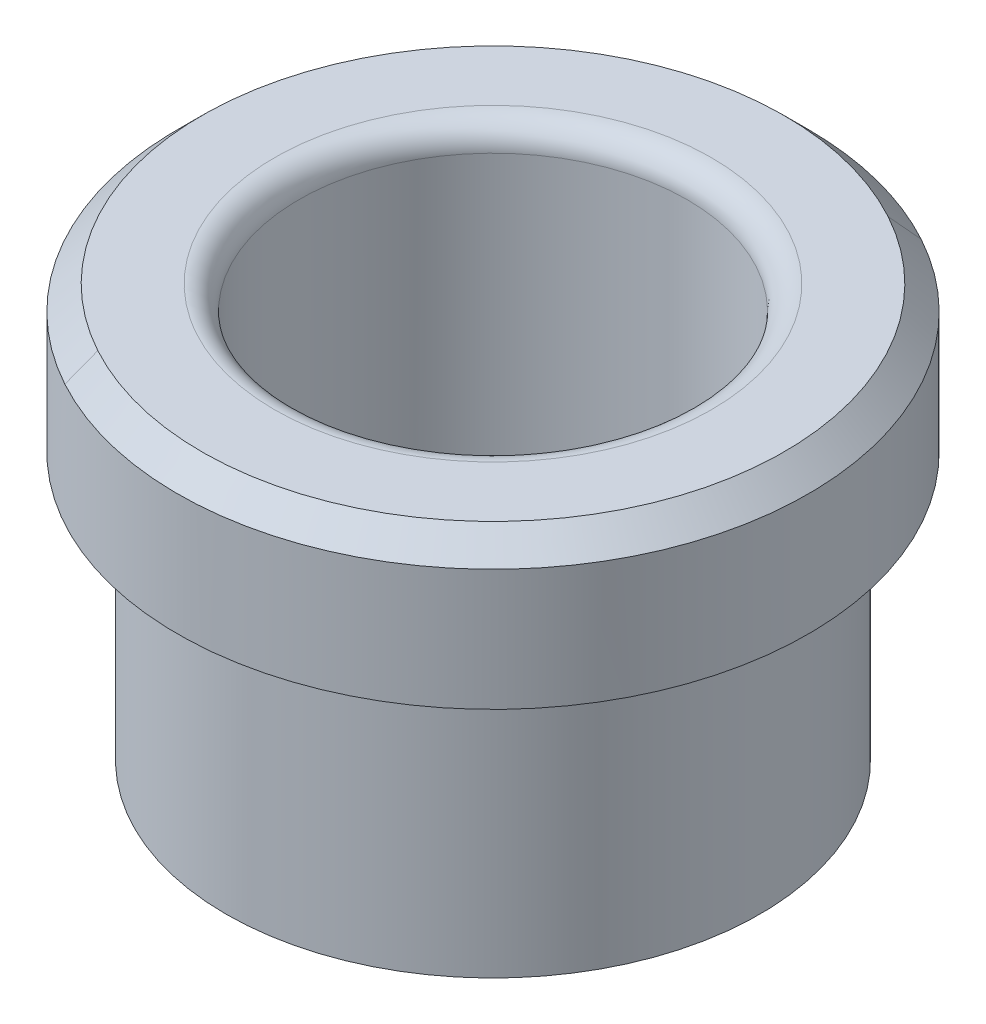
ISO-10303-21;
HEADER;
FILE_DESCRIPTION(('STEP AP214'),'2;1');
FILE_NAME('part.step','',(''),(''),'','','');
FILE_SCHEMA(('AUTOMOTIVE_DESIGN { 1 0 10303 214 1 1 1 1 }'));
ENDSEC;
DATA;
#1=APPLICATION_CONTEXT('core data for automotive mechanical design processes');
#2=APPLICATION_PROTOCOL_DEFINITION('international standard','automotive_design',2000,#1);
#3=PRODUCT_CONTEXT('',#1,'mechanical');
#4=PRODUCT('Part','Part','',(#3));
#5=PRODUCT_RELATED_PRODUCT_CATEGORY('part','',(#4));
#6=PRODUCT_DEFINITION_FORMATION('','',#4);
#7=PRODUCT_DEFINITION_CONTEXT('part definition',#1,'design');
#8=PRODUCT_DEFINITION('design','',#6,#7);
#9=PRODUCT_DEFINITION_SHAPE('','',#8);
#10=(LENGTH_UNIT() NAMED_UNIT(*) SI_UNIT(.MILLI.,.METRE.));
#11=(NAMED_UNIT(*) PLANE_ANGLE_UNIT() SI_UNIT($,.RADIAN.));
#12=(NAMED_UNIT(*) SI_UNIT($,.STERADIAN.) SOLID_ANGLE_UNIT());
#13=UNCERTAINTY_MEASURE_WITH_UNIT(LENGTH_MEASURE(1.E-05),#10,'distance_accuracy_value','');
#14=(GEOMETRIC_REPRESENTATION_CONTEXT(3) GLOBAL_UNCERTAINTY_ASSIGNED_CONTEXT((#13)) GLOBAL_UNIT_ASSIGNED_CONTEXT((#10,
#11,#12)) REPRESENTATION_CONTEXT('',''));
#15=CARTESIAN_POINT('',(0.,0.,0.));
#16=DIRECTION('',(0.,0.,1.));
#17=DIRECTION('',(1.,0.,0.));
#18=AXIS2_PLACEMENT_3D('',#15,#16,#17);
#19=CARTESIAN_POINT('',(0.,-9.99999999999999,0.));
#20=DIRECTION('',(0.,-1.,0.));
#21=DIRECTION('',(0.,0.,-1.));
#22=AXIS2_PLACEMENT_3D('',#19,#20,#21);
#23=CYLINDRICAL_SURFACE('',#22,8.);
#24=CARTESIAN_POINT('',(0.,-16.,0.));
#25=DIRECTION('',(0.,-1.,0.));
#26=DIRECTION('',(0.,0.,-1.));
#27=AXIS2_PLACEMENT_3D('',#24,#25,#26);
#28=CIRCLE('',#27,8.);
#29=CARTESIAN_POINT('',(0.,-16.,-8.));
#30=VERTEX_POINT('',#29);
#31=EDGE_CURVE('E11',#30,#30,#28,.T.);
#32=ORIENTED_EDGE('',*,*,#31,.T.);
#33=EDGE_LOOP('',(#32));
#34=FACE_BOUND('',#33,.T.);
#35=CARTESIAN_POINT('',(0.,-1.,0.));
#36=DIRECTION('',(0.,-1.,0.));
#37=DIRECTION('',(0.,0.,-1.));
#38=AXIS2_PLACEMENT_3D('',#35,#36,#37);
#39=CIRCLE('',#38,8.);
#40=CARTESIAN_POINT('',(0.,-1.,-8.));
#41=VERTEX_POINT('',#40);
#42=EDGE_CURVE('E66',#41,#41,#39,.T.);
#43=ORIENTED_EDGE('',*,*,#42,.F.);
#44=EDGE_LOOP('',(#43));
#45=FACE_BOUND('',#44,.T.);
#46=ADVANCED_FACE('F30',(#34,#45),#23,.F.);
#47=CARTESIAN_POINT('',(0.,-9.99999999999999,0.));
#48=DIRECTION('',(0.,-1.,0.));
#49=DIRECTION('',(0.,0.,-1.));
#50=AXIS2_PLACEMENT_3D('',#47,#48,#49);
#51=CYLINDRICAL_SURFACE('',#50,11.);
#52=CARTESIAN_POINT('',(0.,-6.00000000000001,0.));
#53=DIRECTION('',(0.,-1.,0.));
#54=DIRECTION('',(0.,0.,-1.));
#55=AXIS2_PLACEMENT_3D('',#52,#53,#54);
#56=CIRCLE('',#55,11.);
#57=CARTESIAN_POINT('',(0.,-6.00000000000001,-11.));
#58=VERTEX_POINT('',#57);
#59=EDGE_CURVE('E113',#58,#58,#56,.T.);
#60=ORIENTED_EDGE('',*,*,#59,.T.);
#61=EDGE_LOOP('',(#60));
#62=FACE_BOUND('',#61,.T.);
#63=CARTESIAN_POINT('',(0.,-17.,0.));
#64=DIRECTION('',(0.,-1.,0.));
#65=DIRECTION('',(0.,0.,-1.));
#66=AXIS2_PLACEMENT_3D('',#63,#64,#65);
#67=CIRCLE('',#66,11.);
#68=CARTESIAN_POINT('',(0.,-17.,-11.));
#69=VERTEX_POINT('',#68);
#70=EDGE_CURVE('E147',#69,#69,#67,.T.);
#71=ORIENTED_EDGE('',*,*,#70,.F.);
#72=EDGE_LOOP('',(#71));
#73=FACE_BOUND('',#72,.T.);
#74=ADVANCED_FACE('F32',(#62,#73),#51,.T.);
#75=CARTESIAN_POINT('',(0.,-1.,0.));
#76=DIRECTION('',(0.,-1.,0.));
#77=DIRECTION('',(0.35834444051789,0.,-0.933589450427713));
#78=AXIS2_PLACEMENT_3D('',#75,#76,#77);
#79=TOROIDAL_SURFACE('',#78,9.,1.);
#80=ORIENTED_EDGE('',*,*,#42,.T.);
#81=EDGE_LOOP('',(#80));
#82=FACE_BOUND('',#81,.T.);
#83=CARTESIAN_POINT('',(0.,0.,0.));
#84=DIRECTION('',(0.,1.,0.));
#85=DIRECTION('',(-0.47942553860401,0.,0.877582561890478));
#86=AXIS2_PLACEMENT_3D('',#83,#84,#85);
#87=CIRCLE('',#86,8.99999999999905);
#88=CARTESIAN_POINT('',(-4.31482984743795,0.,7.89824305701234));
#89=VERTEX_POINT('',#88);
#90=CARTESIAN_POINT('',(4.3148297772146,0.,-7.89824309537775));
#91=VERTEX_POINT('',#90);
#92=EDGE_CURVE('E157',#89,#91,#87,.T.);
#93=ORIENTED_EDGE('',*,*,#92,.T.);
#94=CARTESIAN_POINT('',(4.31482975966,0.,-7.89824310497));
#95=CARTESIAN_POINT('',(4.18559642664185,0.,-7.96884715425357));
#96=CARTESIAN_POINT('',(4.05462756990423,0.,-8.03627379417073));
#97=CARTESIAN_POINT('',(3.78954030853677,0.,-8.16462217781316));
#98=CARTESIAN_POINT('',(3.65542190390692,0.,-8.22554392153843));
#99=CARTESIAN_POINT('',(3.38435704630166,0.,-8.34073243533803));
#100=CARTESIAN_POINT('',(3.24741059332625,0.,-8.39499920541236));
#101=CARTESIAN_POINT('',(2.97101998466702,0.,-8.49674792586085));
#102=CARTESIAN_POINT('',(2.83157582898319,0.,-8.544229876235));
#103=CARTESIAN_POINT('',(2.55052563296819,0.,-8.63229433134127));
#104=CARTESIAN_POINT('',(2.40891959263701,0.,-8.67287683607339));
#105=CARTESIAN_POINT('',(2.12388679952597,0.,-8.74704469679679));
#106=CARTESIAN_POINT('',(1.98046004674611,0.,-8.78063005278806));
#107=CARTESIAN_POINT('',(1.69213134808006,0.,-8.84072268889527));
#108=CARTESIAN_POINT('',(1.54722940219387,0.,-8.86722996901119));
#109=CARTESIAN_POINT('',(1.25629940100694,0.,-8.91310259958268));
#110=CARTESIAN_POINT('',(1.11027134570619,0.,-8.93246795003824));
#111=CARTESIAN_POINT('',(0.817440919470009,0.,-8.96401006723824));
#112=CARTESIAN_POINT('',(0.670638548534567,0.,-8.97618683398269));
#113=CARTESIAN_POINT('',(0.376613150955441,0.,-8.99332244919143));
#114=CARTESIAN_POINT('',(0.229390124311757,0.,-8.99828129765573));
#115=CARTESIAN_POINT('',(-0.0651219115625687,0.,-9.00096912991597));
#116=CARTESIAN_POINT('',(-0.21241092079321,0.,-8.99869811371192));
#117=CARTESIAN_POINT('',(-0.506700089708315,0.,-8.98693168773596));
#118=CARTESIAN_POINT('',(-0.653700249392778,0.,-8.97743627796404));
#119=CARTESIAN_POINT('',(-0.947057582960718,0.,-8.95124394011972));
#120=CARTESIAN_POINT('',(-1.09341475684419,0.,-8.93454701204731));
#121=CARTESIAN_POINT('',(-1.38513353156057,0.,-8.8939918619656));
#122=CARTESIAN_POINT('',(-1.53049513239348,0.,-8.8701336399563));
#123=CARTESIAN_POINT('',(-1.81987257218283,0.,-8.81531337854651));
#124=CARTESIAN_POINT('',(-1.96388841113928,0.,-8.78435133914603));
#125=CARTESIAN_POINT('',(-2.25022738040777,0.,-8.71539803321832));
#126=CARTESIAN_POINT('',(-2.39255051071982,0.,-8.6774067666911));
#127=CARTESIAN_POINT('',(-2.67516119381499,0.,-8.59448653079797));
#128=CARTESIAN_POINT('',(-2.81544874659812,0.,-8.54955756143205));
#129=CARTESIAN_POINT('',(-3.09365030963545,0.,-8.45287015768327));
#130=CARTESIAN_POINT('',(-3.23156431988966,0.,-8.40111172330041));
#131=CARTESIAN_POINT('',(-3.50468655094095,0.,-8.29089008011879));
#132=CARTESIAN_POINT('',(-3.63989477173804,0.,-8.23242687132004));
#133=CARTESIAN_POINT('',(-3.90727969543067,0.,-8.1089365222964));
#134=CARTESIAN_POINT('',(-4.03945639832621,0.,-8.04390938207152));
#135=CARTESIAN_POINT('',(-4.30045986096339,0.,-7.90744782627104));
#136=CARTESIAN_POINT('',(-4.42928662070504,0.,-7.83601341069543));
#137=CARTESIAN_POINT('',(-4.68327984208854,0.,-7.68690939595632));
#138=CARTESIAN_POINT('',(-4.80844630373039,0.,-7.60923979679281));
#139=CARTESIAN_POINT('',(-5.05481739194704,0.,-7.44785252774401));
#140=CARTESIAN_POINT('',(-5.17602201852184,0.,-7.36413485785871));
#141=CARTESIAN_POINT('',(-5.41417744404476,0.,-7.19085313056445));
#142=CARTESIAN_POINT('',(-5.53112824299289,0.,-7.1012890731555));
#143=CARTESIAN_POINT('',(-5.76049426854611,0.,-6.91653033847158));
#144=CARTESIAN_POINT('',(-5.87290949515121,0.,-6.82133566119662));
#145=CARTESIAN_POINT('',(-6.09293355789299,0.,-6.62554501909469));
#146=CARTESIAN_POINT('',(-6.20054239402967,0.,-6.52494905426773));
#147=CARTESIAN_POINT('',(-6.41069443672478,0.,-6.31859818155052));
#148=CARTESIAN_POINT('',(-6.51323764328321,0.,-6.21284327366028));
#149=CARTESIAN_POINT('',(-6.71301139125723,0.,-5.99642928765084));
#150=CARTESIAN_POINT('',(-6.81024193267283,0.,-5.88577020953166));
#151=CARTESIAN_POINT('',(-6.99915611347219,0.,-5.65981447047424));
#152=CARTESIAN_POINT('',(-7.09083975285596,0.,-5.54451780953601));
#153=CARTESIAN_POINT('',(-7.26843925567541,0.,-5.30956466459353));
#154=CARTESIAN_POINT('',(-7.35435511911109,0.,-5.18990818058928));
#155=CARTESIAN_POINT('',(-7.52021209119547,0.,-4.94652365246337));
#156=CARTESIAN_POINT('',(-7.60015319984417,0.,-4.8227956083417));
#157=CARTESIAN_POINT('',(-7.75386807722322,0.,-4.57156603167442));
#158=CARTESIAN_POINT('',(-7.82764184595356,0.,-4.44406449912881));
#159=CARTESIAN_POINT('',(-7.96884431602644,0.,-4.18559510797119));
#160=CARTESIAN_POINT('',(-8.03627301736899,0.,-4.05462724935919));
#161=CARTESIAN_POINT('',(-8.16462291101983,0.,-3.78954071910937));
#162=CARTESIAN_POINT('',(-8.22554410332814,0.,-3.65542204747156));
#163=CARTESIAN_POINT('',(-8.34073221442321,0.,-3.38435699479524));
#164=CARTESIAN_POINT('',(-8.39499913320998,0.,-3.24741061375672));
#165=CARTESIAN_POINT('',(-8.49674796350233,0.,-2.97102005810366));
#166=CARTESIAN_POINT('',(-8.54422987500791,0.,-2.83157588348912));
#167=CARTESIAN_POINT('',(-8.63229430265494,0.,-2.55052567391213));
#168=CARTESIAN_POINT('',(-8.67287681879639,0.,-2.40891963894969));
#169=CARTESIAN_POINT('',(-8.74704468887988,0.,-2.12388685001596));
#170=CARTESIAN_POINT('',(-8.78063004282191,0.,-1.98046009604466));
#171=CARTESIAN_POINT('',(-8.84072267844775,0.,-1.69213139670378));
#172=CARTESIAN_POINT('',(-8.86722996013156,0.,-1.5472294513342));
#173=CARTESIAN_POINT('',(-8.91310259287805,0.,-1.25629945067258));
#174=CARTESIAN_POINT('',(-8.93246794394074,0.,-1.11027139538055));
#175=CARTESIAN_POINT('',(-8.96401006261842,0.,-0.817440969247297));
#176=CARTESIAN_POINT('',(-8.97618683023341,0.,-0.670638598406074));
#177=CARTESIAN_POINT('',(-8.99332244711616,0.,-0.376613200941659));
#178=CARTESIAN_POINT('',(-8.99828129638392,0.,-0.229390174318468));
#179=CARTESIAN_POINT('',(-9.00096913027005,0.,0.065121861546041));
#180=CARTESIAN_POINT('',(-8.99869811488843,0.,0.212410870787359));
#181=CARTESIAN_POINT('',(-8.98693169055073,0.,0.506700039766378));
#182=CARTESIAN_POINT('',(-8.97743628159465,0.,0.653700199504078));
#183=CARTESIAN_POINT('',(-8.95124394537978,0.,0.947057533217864));
#184=CARTESIAN_POINT('',(-8.93454701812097,0.,1.09341470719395));
#185=CARTESIAN_POINT('',(-8.89399186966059,0.,1.38513348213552));
#186=CARTESIAN_POINT('',(-8.87013364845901,0.,1.530495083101));
#187=CARTESIAN_POINT('',(-8.81531338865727,0.,1.81987252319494));
#188=CARTESIAN_POINT('',(-8.78435135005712,0.,1.9638883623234));
#189=CARTESIAN_POINT('',(-8.71539804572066,0.,2.25022733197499));
#190=CARTESIAN_POINT('',(-8.67740677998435,0.,2.39255046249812));
#191=CARTESIAN_POINT('',(-8.59448654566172,0.,2.67516114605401));
#192=CARTESIAN_POINT('',(-8.5495575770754,0.,2.81544869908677));
#193=CARTESIAN_POINT('',(-8.45287017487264,0.,3.09365026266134));
#194=CARTESIAN_POINT('',(-8.40111174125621,0.,3.23156427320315));
#195=CARTESIAN_POINT('',(-8.29089009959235,0.,3.50468650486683));
#196=CARTESIAN_POINT('',(-8.23242689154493,0.,3.6398947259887));
#197=CARTESIAN_POINT('',(-8.10893654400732,0.,3.90727965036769));
#198=CARTESIAN_POINT('',(-8.04390940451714,0.,4.03945635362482));
#199=CARTESIAN_POINT('',(-7.90744785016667,0.,4.30045981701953));
#200=CARTESIAN_POINT('',(-7.83601343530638,0.,4.42928657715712));
#201=CARTESIAN_POINT('',(-7.68690942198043,0.,4.68327979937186));
#202=CARTESIAN_POINT('',(-7.60923982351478,0.,4.80844626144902));
#203=CARTESIAN_POINT('',(-7.4478525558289,0.,5.05481735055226));
#204=CARTESIAN_POINT('',(-7.36413488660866,0.,5.17602197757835));
#205=CARTESIAN_POINT('',(-7.19085316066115,0.,5.41417740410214));
#206=CARTESIAN_POINT('',(-7.10128910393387,0.,5.53112820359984));
#207=CARTESIAN_POINT('',(-6.91653037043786,0.,5.76049423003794));
#208=CARTESIAN_POINT('',(-6.82133569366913,0.,5.87290945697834));
#209=CARTESIAN_POINT('',(-6.62554505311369,0.,6.0929335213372));
#210=CARTESIAN_POINT('',(-6.52494908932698,0.,6.20054235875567));
#211=CARTESIAN_POINT('',(-6.31859821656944,0.,6.41069440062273));
#212=CARTESIAN_POINT('',(-6.21284330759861,0.,6.51323760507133));
#213=CARTESIAN_POINT('',(-5.99642932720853,0.,6.71301136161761));
#214=CARTESIAN_POINT('',(-5.88577025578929,0.,6.81024191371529));
#215=CARTESIAN_POINT('',(-5.65981450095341,0.,6.99915606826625));
#216=CARTESIAN_POINT('',(-5.54451781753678,0.,7.09083967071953));
#217=CARTESIAN_POINT('',(-5.30956473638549,0.,7.26843927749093));
#218=CARTESIAN_POINT('',(-5.18990833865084,0.,7.35435528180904));
#219=CARTESIAN_POINT('',(-4.94652357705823,0.,7.52021187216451));
#220=CARTESIAN_POINT('',(-4.82279521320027,0.,7.60015245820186));
#221=CARTESIAN_POINT('',(-4.57156651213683,0.,7.75386876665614));
#222=CARTESIAN_POINT('',(-4.44406617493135,0.,7.82764448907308));
#223=CARTESIAN_POINT('',(-4.31482984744,0.,7.89824305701));
#224=B_SPLINE_CURVE_WITH_KNOTS('',3,(#94,#95,#96,#97,#98,#99,#100,#101,#102,#103,#104,#105,#106,
#107,#108,#109,#110,#111,#112,#113,#114,#115,#116,#117,#118,#119,#120,#121,#122,#123,#124,#125,
#126,#127,#128,#129,#130,#131,#132,#133,#134,#135,#136,#137,#138,#139,#140,#141,#142,#143,#144,
#145,#146,#147,#148,#149,#150,#151,#152,#153,#154,#155,#156,#157,#158,#159,#160,#161,#162,#163,
#164,#165,#166,#167,#168,#169,#170,#171,#172,#173,#174,#175,#176,#177,#178,#179,#180,#181,#182,
#183,#184,#185,#186,#187,#188,#189,#190,#191,#192,#193,#194,#195,#196,#197,#198,#199,#200,#201,
#202,#203,#204,#205,#206,#207,#208,#209,#210,#211,#212,#213,#214,#215,#216,#217,#218,#219,#220,
#221,#222,#223),.UNSPECIFIED.,.F.,.F.,(4,2,2,2,2,2,2,2,2,2,2,2,2,2,2,2,2,2,2,2,2,2,2,2,2,2,2,2,
2,2,2,2,2,2,2,2,2,2,2,2,2,2,2,2,2,2,2,2,2,2,2,2,2,2,2,2,2,2,2,2,2,2,2,2,4),(0.,
0.441742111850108,0.883484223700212,1.32522633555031,1.76696844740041,2.2087105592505,
2.65045267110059,3.09219478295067,3.53393689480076,3.97567900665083,4.41742111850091,
4.85916323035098,5.30090534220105,5.74264745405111,6.18438956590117,6.62613167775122,
7.06787378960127,7.50961590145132,7.95135801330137,8.39310012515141,8.83484223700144,
9.27658434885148,9.7183264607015,10.1600685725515,10.6018106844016,11.0435527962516,
11.4852949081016,11.9270370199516,12.3687791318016,12.8105212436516,13.2522633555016,
13.6940054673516,14.1357475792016,14.5774896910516,15.0192318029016,15.4609739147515,
15.9027160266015,16.3444581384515,16.7862002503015,17.2279423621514,17.6696844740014,
18.1114265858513,18.5531686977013,18.9949108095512,19.4366529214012,19.8783950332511,
20.3201371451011,20.761879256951,21.2036213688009,21.6453634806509,22.0871055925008,
22.5288477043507,22.9705898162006,23.4123319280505,23.8540740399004,24.2958161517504,
24.7375582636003,25.1793003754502,25.6210424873,26.0627845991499,26.5045267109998,
26.9462688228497,27.3880109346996,27.8297530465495,28.2714951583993),.UNSPECIFIED.);
#225=EDGE_CURVE('E124',#91,#89,#224,.T.);
#226=ORIENTED_EDGE('',*,*,#225,.T.);
#227=EDGE_LOOP('',(#93,#226));
#228=FACE_BOUND('',#227,.T.);
#229=ADVANCED_FACE('F129',(#82,#228),#79,.T.);
#230=CARTESIAN_POINT('',(0.,0.,8.00000000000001));
#231=DIRECTION('',(0.,-1.,0.));
#232=DIRECTION('',(0.,0.,-1.));
#233=AXIS2_PLACEMENT_3D('',#230,#231,#232);
#234=PLANE('',#233);
#235=ORIENTED_EDGE('',*,*,#225,.F.);
#236=ORIENTED_EDGE('',*,*,#92,.F.);
#237=EDGE_LOOP('',(#235,#236));
#238=FACE_BOUND('',#237,.T.);
#239=CARTESIAN_POINT('',(0.,0.,0.));
#240=DIRECTION('',(0.,-1.,0.));
#241=DIRECTION('',(1.,0.,0.));
#242=AXIS2_PLACEMENT_3D('',#239,#240,#241);
#243=CIRCLE('',#242,12.0000000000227);
#244=CARTESIAN_POINT('',(5.75310652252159,0.,-10.5309907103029));
#245=VERTEX_POINT('',#244);
#246=CARTESIAN_POINT('',(-5.75310646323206,-3.33066907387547E-12,10.530990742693));
#247=VERTEX_POINT('',#246);
#248=EDGE_CURVE('E60',#245,#247,#243,.T.);
#249=ORIENTED_EDGE('',*,*,#248,.F.);
#250=CARTESIAN_POINT('',(0.,-6.66133814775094E-12,0.));
#251=DIRECTION('',(0.,-1.,0.));
#252=DIRECTION('',(1.,0.,0.));
#253=AXIS2_PLACEMENT_3D('',#250,#251,#252);
#254=CIRCLE('',#253,11.9999999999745);
#255=EDGE_CURVE('E68',#247,#245,#254,.T.);
#256=ORIENTED_EDGE('',*,*,#255,.F.);
#257=EDGE_LOOP('',(#249,#256));
#258=FACE_BOUND('',#257,.T.);
#259=ADVANCED_FACE('F69',(#238,#258),#234,.F.);
#260=CARTESIAN_POINT('',(0.,-0.999999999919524,0.));
#261=DIRECTION('',(0.,-1.,0.));
#262=DIRECTION('',(1.,0.,0.));
#263=AXIS2_PLACEMENT_3D('',#260,#261,#262);
#264=CONICAL_SURFACE('',#263,12.9999999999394,0.785398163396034);
#265=DIRECTION('',(0.339005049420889,0.707106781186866,-0.620544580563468));
#266=VECTOR('',#265,1.);
#267=CARTESIAN_POINT('',(-239239.096869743,-499000.,437924.229373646));
#268=LINE('',#267,#266);
#269=CARTESIAN_POINT('',(-6.23253200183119,-0.999999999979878,11.4085733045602));
#270=VERTEX_POINT('',#269);
#271=EDGE_CURVE('E47',#270,#247,#268,.T.);
#272=ORIENTED_EDGE('',*,*,#271,.F.);
#273=CARTESIAN_POINT('',(0.,-1.,0.));
#274=DIRECTION('',(0.,-1.,0.));
#275=DIRECTION('',(0.,0.,-1.));
#276=AXIS2_PLACEMENT_3D('',#273,#274,#275);
#277=CIRCLE('',#276,13.);
#278=CARTESIAN_POINT('',(6.23253200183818,-1.00000000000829,-11.4085733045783));
#279=VERTEX_POINT('',#278);
#280=EDGE_CURVE('E84',#279,#270,#277,.T.);
#281=ORIENTED_EDGE('',*,*,#280,.F.);
#282=CARTESIAN_POINT('',(5.75310652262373,0.,-10.5309907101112));
#283=CARTESIAN_POINT('',(5.77308258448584,-0.0416666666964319,-10.5675566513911));
#284=CARTESIAN_POINT('',(5.79305864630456,-0.0833333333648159,-10.6041225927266));
#285=CARTESIAN_POINT('',(5.83301076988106,-0.166666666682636,-10.6772544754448));
#286=CARTESIAN_POINT('',(5.85298683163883,-0.208333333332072,-10.7138204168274));
#287=CARTESIAN_POINT('',(5.89293895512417,-0.291666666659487,-10.7869522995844));
#288=CARTESIAN_POINT('',(5.91291501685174,-0.333333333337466,-10.8235182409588));
#289=CARTESIAN_POINT('',(5.95286714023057,-0.416666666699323,-10.8966501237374));
#290=CARTESIAN_POINT('',(5.97284320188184,-0.458333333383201,-10.9332160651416));
#291=CARTESIAN_POINT('',(6.01279532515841,-0.541666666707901,-11.0063479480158));
#292=CARTESIAN_POINT('',(6.03277138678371,-0.583333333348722,-11.0429138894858));
#293=CARTESIAN_POINT('',(6.07272350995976,-0.666666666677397,-11.1160457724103));
#294=CARTESIAN_POINT('',(6.09269957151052,-0.70833333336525,-11.1526117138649));
#295=CARTESIAN_POINT('',(6.13265169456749,-0.791666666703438,-11.2257435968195));
#296=CARTESIAN_POINT('',(6.15262775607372,-0.833333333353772,-11.2623095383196));
#297=CARTESIAN_POINT('',(6.19257987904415,-0.916666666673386,-11.3354414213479));
#298=CARTESIAN_POINT('',(6.21255594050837,-0.958333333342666,-11.372007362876));
#299=CARTESIAN_POINT('',(6.23253200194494,-1.00000000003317,-11.4085733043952));
#300=B_SPLINE_CURVE_WITH_KNOTS('',3,(#282,#283,#284,#285,#286,#287,#288,#289,#290,#291,#292,
#293,#294,#295,#296,#297,#298,#299),.UNSPECIFIED.,.F.,.F.,(4,2,2,2,2,2,2,2,4),(0.,
0.176776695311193,0.353553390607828,0.530330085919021,0.707106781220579,0.883883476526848,
1.0606601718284,1.23743686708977,1.41421356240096),.UNSPECIFIED.);
#301=EDGE_CURVE('E64',#245,#279,#300,.T.);
#302=ORIENTED_EDGE('',*,*,#301,.F.);
#303=ORIENTED_EDGE('',*,*,#248,.T.);
#304=EDGE_LOOP('',(#272,#281,#302,#303));
#305=FACE_BOUND('',#304,.T.);
#306=ADVANCED_FACE('F62',(#305),#264,.T.);
#307=CARTESIAN_POINT('',(0.,-1.00000000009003,0.));
#308=DIRECTION('',(0.,-1.,0.));
#309=DIRECTION('',(1.,0.,0.));
#310=AXIS2_PLACEMENT_3D('',#307,#308,#309);
#311=CONICAL_SURFACE('',#310,13.0000000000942,0.785398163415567);
#312=ORIENTED_EDGE('',*,*,#301,.T.);
#313=CARTESIAN_POINT('',(0.,-1.,0.));
#314=DIRECTION('',(0.,-1.,0.));
#315=DIRECTION('',(0.,0.,-1.));
#316=AXIS2_PLACEMENT_3D('',#313,#314,#315);
#317=CIRCLE('',#316,13.);
#318=EDGE_CURVE('E75',#270,#279,#317,.T.);
#319=ORIENTED_EDGE('',*,*,#318,.F.);
#320=ORIENTED_EDGE('',*,*,#271,.T.);
#321=ORIENTED_EDGE('',*,*,#255,.T.);
#322=EDGE_LOOP('',(#312,#319,#320,#321));
#323=FACE_BOUND('',#322,.T.);
#324=ADVANCED_FACE('F73',(#323),#311,.T.);
#325=CARTESIAN_POINT('',(0.,-9.99999999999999,0.));
#326=DIRECTION('',(0.,-1.,0.));
#327=DIRECTION('',(0.,0.,-1.));
#328=AXIS2_PLACEMENT_3D('',#325,#326,#327);
#329=CYLINDRICAL_SURFACE('',#328,13.);
#330=CARTESIAN_POINT('',(0.,-6.00000000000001,0.));
#331=DIRECTION('',(0.,-1.,0.));
#332=DIRECTION('',(0.,0.,-1.));
#333=AXIS2_PLACEMENT_3D('',#330,#331,#332);
#334=CIRCLE('',#333,13.);
#335=CARTESIAN_POINT('',(0.,-6.00000000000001,-13.));
#336=VERTEX_POINT('',#335);
#337=EDGE_CURVE('E110',#336,#336,#334,.T.);
#338=ORIENTED_EDGE('',*,*,#337,.F.);
#339=EDGE_LOOP('',(#338));
#340=FACE_BOUND('',#339,.T.);
#341=ORIENTED_EDGE('',*,*,#318,.T.);
#342=ORIENTED_EDGE('',*,*,#280,.T.);
#343=EDGE_LOOP('',(#341,#342));
#344=FACE_BOUND('',#343,.T.);
#345=ADVANCED_FACE('F171',(#340,#344),#329,.T.);
#346=CARTESIAN_POINT('',(0.,-6.00000000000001,13.));
#347=DIRECTION('',(0.,-1.,0.));
#348=DIRECTION('',(0.,0.,-1.));
#349=AXIS2_PLACEMENT_3D('',#346,#347,#348);
#350=PLANE('',#349);
#351=ORIENTED_EDGE('',*,*,#59,.F.);
#352=EDGE_LOOP('',(#351));
#353=FACE_BOUND('',#352,.T.);
#354=ORIENTED_EDGE('',*,*,#337,.T.);
#355=EDGE_LOOP('',(#354));
#356=FACE_BOUND('',#355,.T.);
#357=ADVANCED_FACE('F165',(#353,#356),#350,.T.);
#358=CARTESIAN_POINT('',(0.,-17.,0.));
#359=DIRECTION('',(0.,-1.,0.));
#360=DIRECTION('',(0.,0.,-1.));
#361=AXIS2_PLACEMENT_3D('',#358,#359,#360);
#362=PLANE('',#361);
#363=CARTESIAN_POINT('',(0.,-17.,0.));
#364=DIRECTION('',(0.,-1.,0.));
#365=DIRECTION('',(0.,0.,-1.));
#366=AXIS2_PLACEMENT_3D('',#363,#364,#365);
#367=CIRCLE('',#366,9.);
#368=CARTESIAN_POINT('',(0.,-17.,-9.));
#369=VERTEX_POINT('',#368);
#370=EDGE_CURVE('E39',#369,#369,#367,.F.);
#371=ORIENTED_EDGE('',*,*,#370,.T.);
#372=EDGE_LOOP('',(#371));
#373=FACE_BOUND('',#372,.T.);
#374=ORIENTED_EDGE('',*,*,#70,.T.);
#375=EDGE_LOOP('',(#374));
#376=FACE_BOUND('',#375,.T.);
#377=ADVANCED_FACE('F140',(#373,#376),#362,.T.);
#378=CARTESIAN_POINT('',(0.,-16.,0.));
#379=DIRECTION('',(0.,-1.,0.));
#380=DIRECTION('',(0.,0.,-1.));
#381=AXIS2_PLACEMENT_3D('',#378,#379,#380);
#382=TOROIDAL_SURFACE('',#381,9.,1.);
#383=ORIENTED_EDGE('',*,*,#31,.F.);
#384=EDGE_LOOP('',(#383));
#385=FACE_BOUND('',#384,.T.);
#386=ORIENTED_EDGE('',*,*,#370,.F.);
#387=EDGE_LOOP('',(#386));
#388=FACE_BOUND('',#387,.T.);
#389=ADVANCED_FACE('F177',(#385,#388),#382,.T.);
#390=CLOSED_SHELL('',(#46,#74,#229,#259,#306,#324,#345,#357,#377,#389));
#391=MANIFOLD_SOLID_BREP('B2',#390);
#392=ADVANCED_BREP_SHAPE_REPRESENTATION('',(#18,#391),#14);
#393=SHAPE_DEFINITION_REPRESENTATION(#9,#392);
ENDSEC;
END-ISO-10303-21;
